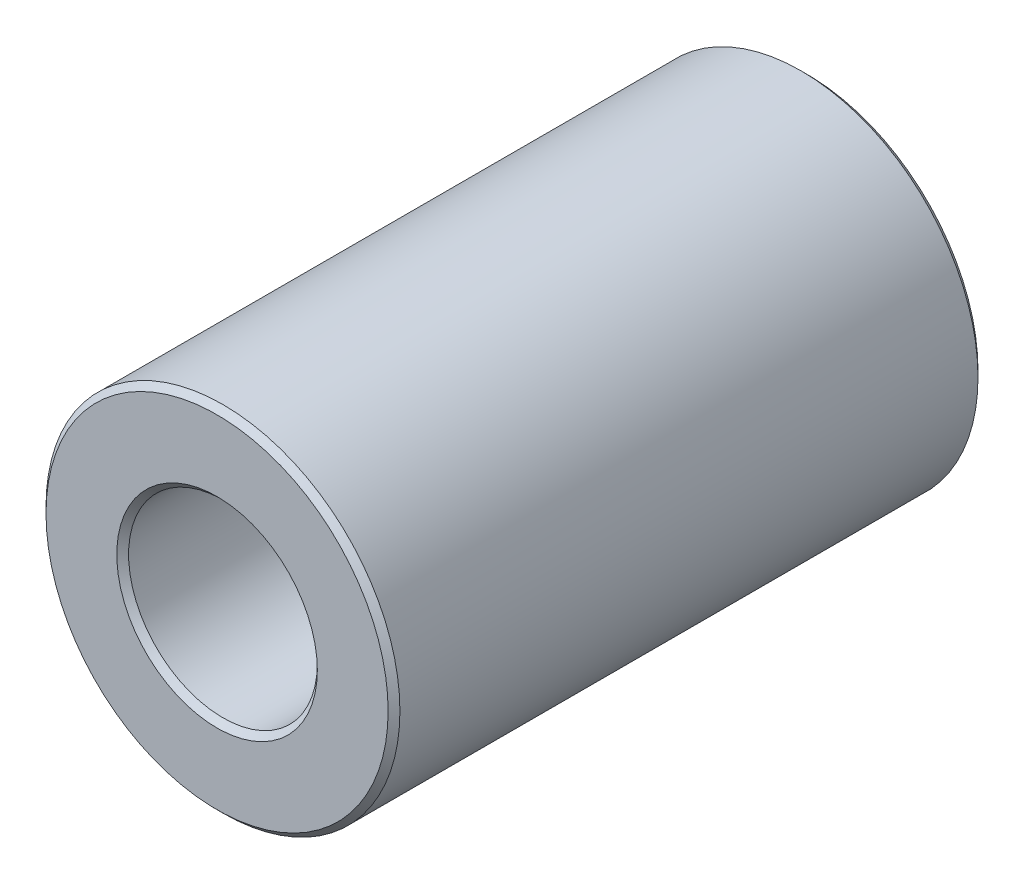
ISO-10303-21;
HEADER;
FILE_DESCRIPTION(('STEP AP214'),'2;1');
FILE_NAME('part.step','',(''),(''),'','','');
FILE_SCHEMA(('AUTOMOTIVE_DESIGN { 1 0 10303 214 1 1 1 1 }'));
ENDSEC;
DATA;
#1=APPLICATION_CONTEXT('core data for automotive mechanical design processes');
#2=APPLICATION_PROTOCOL_DEFINITION('international standard','automotive_design',2000,#1);
#3=PRODUCT_CONTEXT('',#1,'mechanical');
#4=PRODUCT('Part','Part','',(#3));
#5=PRODUCT_RELATED_PRODUCT_CATEGORY('part','',(#4));
#6=PRODUCT_DEFINITION_FORMATION('','',#4);
#7=PRODUCT_DEFINITION_CONTEXT('part definition',#1,'design');
#8=PRODUCT_DEFINITION('design','',#6,#7);
#9=PRODUCT_DEFINITION_SHAPE('','',#8);
#10=(LENGTH_UNIT() NAMED_UNIT(*) SI_UNIT(.MILLI.,.METRE.));
#11=(NAMED_UNIT(*) PLANE_ANGLE_UNIT() SI_UNIT($,.RADIAN.));
#12=(NAMED_UNIT(*) SI_UNIT($,.STERADIAN.) SOLID_ANGLE_UNIT());
#13=UNCERTAINTY_MEASURE_WITH_UNIT(LENGTH_MEASURE(1.E-05),#10,'distance_accuracy_value','');
#14=(GEOMETRIC_REPRESENTATION_CONTEXT(3) GLOBAL_UNCERTAINTY_ASSIGNED_CONTEXT((#13)) GLOBAL_UNIT_ASSIGNED_CONTEXT((#10,
#11,#12)) REPRESENTATION_CONTEXT('',''));
#15=CARTESIAN_POINT('',(0.,0.,0.));
#16=DIRECTION('',(0.,0.,1.));
#17=DIRECTION('',(1.,0.,0.));
#18=AXIS2_PLACEMENT_3D('',#15,#16,#17);
#19=CARTESIAN_POINT('',(0.,0.,5.));
#20=DIRECTION('',(0.,0.,1.));
#21=DIRECTION('',(1.,0.,0.));
#22=AXIS2_PLACEMENT_3D('',#19,#20,#21);
#23=PLANE('',#22);
#24=CARTESIAN_POINT('',(0.,0.,5.));
#25=DIRECTION('',(0.,0.,1.));
#26=DIRECTION('',(1.,0.,0.));
#27=AXIS2_PLACEMENT_3D('',#24,#25,#26);
#28=CIRCLE('',#27,1.7);
#29=CARTESIAN_POINT('',(1.7,0.,5.));
#30=VERTEX_POINT('',#29);
#31=EDGE_CURVE('E10',#30,#30,#28,.F.);
#32=ORIENTED_EDGE('',*,*,#31,.T.);
#33=EDGE_LOOP('',(#32));
#34=FACE_BOUND('',#33,.T.);
#35=CARTESIAN_POINT('',(0.,0.,5.));
#36=DIRECTION('',(0.,0.,1.));
#37=DIRECTION('',(1.,0.,0.));
#38=AXIS2_PLACEMENT_3D('',#35,#36,#37);
#39=CIRCLE('',#38,2.9);
#40=CARTESIAN_POINT('',(2.9,0.,5.));
#41=VERTEX_POINT('',#40);
#42=EDGE_CURVE('E45',#41,#41,#39,.T.);
#43=ORIENTED_EDGE('',*,*,#42,.T.);
#44=EDGE_LOOP('',(#43));
#45=FACE_BOUND('',#44,.T.);
#46=ADVANCED_FACE('F37',(#34,#45),#23,.T.);
#47=CARTESIAN_POINT('',(0.,0.,-5.));
#48=DIRECTION('',(0.,0.,1.));
#49=DIRECTION('',(1.,0.,0.));
#50=AXIS2_PLACEMENT_3D('',#47,#48,#49);
#51=PLANE('',#50);
#52=CARTESIAN_POINT('',(0.,0.,-5.));
#53=DIRECTION('',(0.,0.,1.));
#54=DIRECTION('',(1.,0.,0.));
#55=AXIS2_PLACEMENT_3D('',#52,#53,#54);
#56=CIRCLE('',#55,2.9);
#57=CARTESIAN_POINT('',(2.9,0.,-5.));
#58=VERTEX_POINT('',#57);
#59=EDGE_CURVE('E63',#58,#58,#56,.F.);
#60=ORIENTED_EDGE('',*,*,#59,.T.);
#61=EDGE_LOOP('',(#60));
#62=FACE_BOUND('',#61,.T.);
#63=CARTESIAN_POINT('',(0.,0.,-5.));
#64=DIRECTION('',(0.,0.,1.));
#65=DIRECTION('',(1.,0.,0.));
#66=AXIS2_PLACEMENT_3D('',#63,#64,#65);
#67=CIRCLE('',#66,1.7);
#68=CARTESIAN_POINT('',(1.7,0.,-5.));
#69=VERTEX_POINT('',#68);
#70=EDGE_CURVE('E66',#69,#69,#67,.T.);
#71=ORIENTED_EDGE('',*,*,#70,.T.);
#72=EDGE_LOOP('',(#71));
#73=FACE_BOUND('',#72,.T.);
#74=ADVANCED_FACE('F89',(#62,#73),#51,.F.);
#75=CARTESIAN_POINT('',(0.,0.,5.));
#76=DIRECTION('',(0.,0.,-1.));
#77=DIRECTION('',(-1.,0.,0.));
#78=AXIS2_PLACEMENT_3D('',#75,#76,#77);
#79=CYLINDRICAL_SURFACE('',#78,3.);
#80=CARTESIAN_POINT('',(0.,0.,-4.9));
#81=DIRECTION('',(0.,0.,1.));
#82=DIRECTION('',(1.,0.,0.));
#83=AXIS2_PLACEMENT_3D('',#80,#81,#82);
#84=CIRCLE('',#83,3.);
#85=CARTESIAN_POINT('',(3.,0.,-4.9));
#86=VERTEX_POINT('',#85);
#87=EDGE_CURVE('E70',#86,#86,#84,.T.);
#88=ORIENTED_EDGE('',*,*,#87,.T.);
#89=EDGE_LOOP('',(#88));
#90=FACE_BOUND('',#89,.T.);
#91=CARTESIAN_POINT('',(0.,0.,4.9));
#92=DIRECTION('',(0.,0.,1.));
#93=DIRECTION('',(1.,0.,0.));
#94=AXIS2_PLACEMENT_3D('',#91,#92,#93);
#95=CIRCLE('',#94,3.);
#96=CARTESIAN_POINT('',(3.,0.,4.9));
#97=VERTEX_POINT('',#96);
#98=EDGE_CURVE('E73',#97,#97,#95,.F.);
#99=ORIENTED_EDGE('',*,*,#98,.T.);
#100=EDGE_LOOP('',(#99));
#101=FACE_BOUND('',#100,.T.);
#102=ADVANCED_FACE('F78',(#90,#101),#79,.T.);
#103=CARTESIAN_POINT('',(0.,0.,5.));
#104=DIRECTION('',(0.,0.,-1.));
#105=DIRECTION('',(-1.,0.,0.));
#106=AXIS2_PLACEMENT_3D('',#103,#104,#105);
#107=CYLINDRICAL_SURFACE('',#106,1.6);
#108=CARTESIAN_POINT('',(0.,0.,-4.9));
#109=DIRECTION('',(0.,0.,1.));
#110=DIRECTION('',(1.,0.,0.));
#111=AXIS2_PLACEMENT_3D('',#108,#109,#110);
#112=CIRCLE('',#111,1.6);
#113=CARTESIAN_POINT('',(1.6,0.,-4.9));
#114=VERTEX_POINT('',#113);
#115=EDGE_CURVE('E52',#114,#114,#112,.F.);
#116=ORIENTED_EDGE('',*,*,#115,.T.);
#117=EDGE_LOOP('',(#116));
#118=FACE_BOUND('',#117,.T.);
#119=CARTESIAN_POINT('',(0.,0.,4.9));
#120=DIRECTION('',(0.,0.,1.));
#121=DIRECTION('',(1.,0.,0.));
#122=AXIS2_PLACEMENT_3D('',#119,#120,#121);
#123=CIRCLE('',#122,1.6);
#124=CARTESIAN_POINT('',(1.6,0.,4.9));
#125=VERTEX_POINT('',#124);
#126=EDGE_CURVE('E57',#125,#125,#123,.T.);
#127=ORIENTED_EDGE('',*,*,#126,.T.);
#128=EDGE_LOOP('',(#127));
#129=FACE_BOUND('',#128,.T.);
#130=ADVANCED_FACE('F97',(#118,#129),#107,.F.);
#131=CARTESIAN_POINT('',(0.,0.,-4.9));
#132=DIRECTION('',(0.,0.,1.));
#133=DIRECTION('',(1.,0.,0.));
#134=AXIS2_PLACEMENT_3D('',#131,#132,#133);
#135=CONICAL_SURFACE('',#134,3.,0.785398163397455);
#136=ORIENTED_EDGE('',*,*,#59,.F.);
#137=EDGE_LOOP('',(#136));
#138=FACE_BOUND('',#137,.T.);
#139=ORIENTED_EDGE('',*,*,#87,.F.);
#140=EDGE_LOOP('',(#139));
#141=FACE_BOUND('',#140,.T.);
#142=ADVANCED_FACE('F102',(#138,#141),#135,.T.);
#143=CARTESIAN_POINT('',(0.,0.,-5.));
#144=DIRECTION('',(0.,0.,-1.));
#145=DIRECTION('',(-1.,0.,0.));
#146=AXIS2_PLACEMENT_3D('',#143,#144,#145);
#147=CONICAL_SURFACE('',#146,1.7,0.785398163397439);
#148=ORIENTED_EDGE('',*,*,#115,.F.);
#149=EDGE_LOOP('',(#148));
#150=FACE_BOUND('',#149,.T.);
#151=ORIENTED_EDGE('',*,*,#70,.F.);
#152=EDGE_LOOP('',(#151));
#153=FACE_BOUND('',#152,.T.);
#154=ADVANCED_FACE('F86',(#150,#153),#147,.F.);
#155=CARTESIAN_POINT('',(0.,0.,4.9));
#156=DIRECTION('',(0.,0.,1.));
#157=DIRECTION('',(1.,0.,0.));
#158=AXIS2_PLACEMENT_3D('',#155,#156,#157);
#159=CONICAL_SURFACE('',#158,1.6,0.785398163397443);
#160=ORIENTED_EDGE('',*,*,#31,.F.);
#161=EDGE_LOOP('',(#160));
#162=FACE_BOUND('',#161,.T.);
#163=ORIENTED_EDGE('',*,*,#126,.F.);
#164=EDGE_LOOP('',(#163));
#165=FACE_BOUND('',#164,.T.);
#166=ADVANCED_FACE('F82',(#162,#165),#159,.F.);
#167=CARTESIAN_POINT('',(0.,0.,5.));
#168=DIRECTION('',(0.,0.,-1.));
#169=DIRECTION('',(-1.,0.,0.));
#170=AXIS2_PLACEMENT_3D('',#167,#168,#169);
#171=CONICAL_SURFACE('',#170,2.9,0.785398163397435);
#172=ORIENTED_EDGE('',*,*,#98,.F.);
#173=EDGE_LOOP('',(#172));
#174=FACE_BOUND('',#173,.T.);
#175=ORIENTED_EDGE('',*,*,#42,.F.);
#176=EDGE_LOOP('',(#175));
#177=FACE_BOUND('',#176,.T.);
#178=ADVANCED_FACE('F39',(#174,#177),#171,.T.);
#179=CLOSED_SHELL('',(#46,#74,#102,#130,#142,#154,#166,#178));
#180=MANIFOLD_SOLID_BREP('B2',#179);
#181=ADVANCED_BREP_SHAPE_REPRESENTATION('',(#18,#180),#14);
#182=SHAPE_DEFINITION_REPRESENTATION(#9,#181);
ENDSEC;
END-ISO-10303-21;
